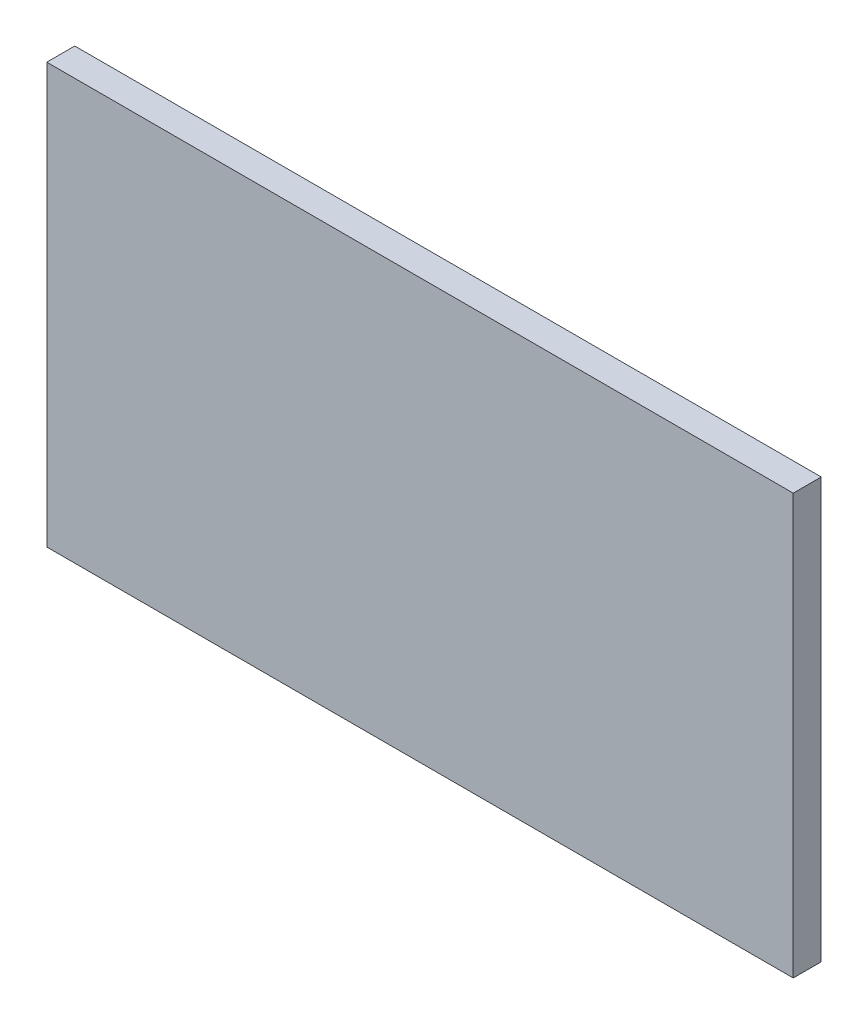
from build123d import *

# Parameters (mm, degrees)
SKETCH_2_W      = 160
SKETCH_2_H      = 90
EXTRUDE_1_DEPTH = 6


with BuildPart() as part:
    # Sketch 2 → Extrude 1 (new body)
    with BuildSketch(Plane.XY):
        with Locations((80, 45)):
            Rectangle(SKETCH_2_W, SKETCH_2_H)
    extrude(amount=EXTRUDE_1_DEPTH)


solid = part.part
